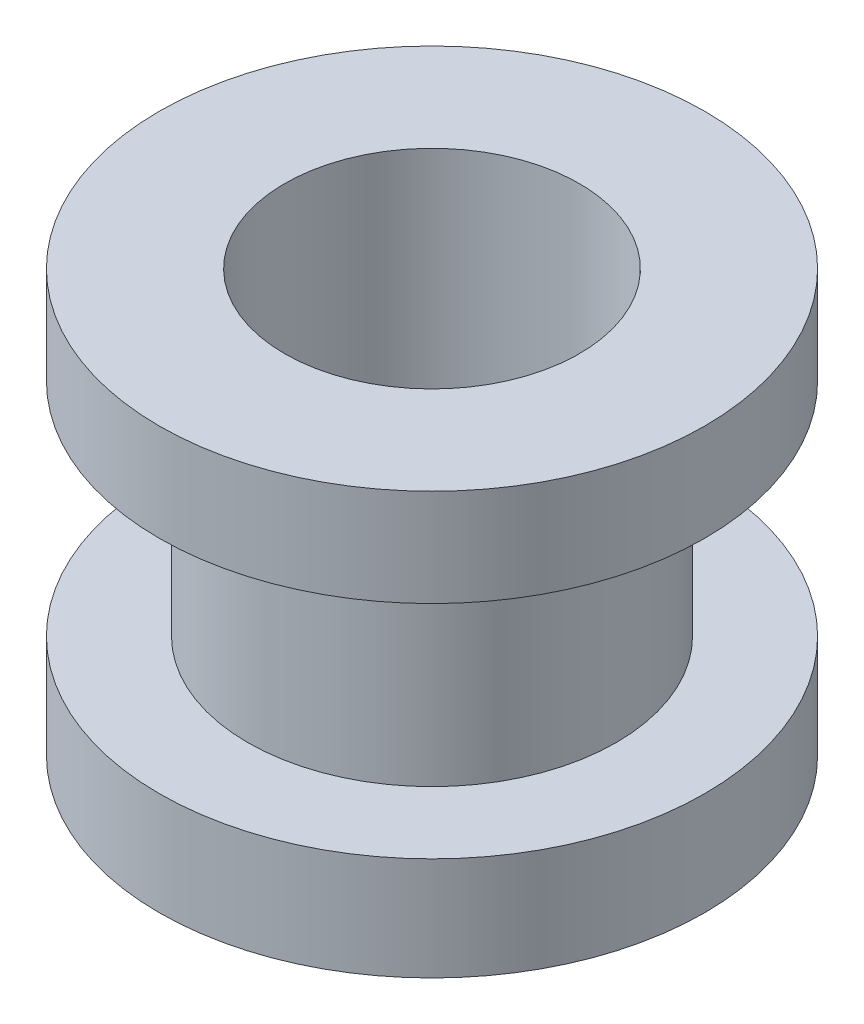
ISO-10303-21;
HEADER;
FILE_DESCRIPTION(('STEP AP214'),'2;1');
FILE_NAME('part.step','',(''),(''),'','','');
FILE_SCHEMA(('AUTOMOTIVE_DESIGN { 1 0 10303 214 1 1 1 1 }'));
ENDSEC;
DATA;
#1=APPLICATION_CONTEXT('core data for automotive mechanical design processes');
#2=APPLICATION_PROTOCOL_DEFINITION('international standard','automotive_design',2000,#1);
#3=PRODUCT_CONTEXT('',#1,'mechanical');
#4=PRODUCT('Part','Part','',(#3));
#5=PRODUCT_RELATED_PRODUCT_CATEGORY('part','',(#4));
#6=PRODUCT_DEFINITION_FORMATION('','',#4);
#7=PRODUCT_DEFINITION_CONTEXT('part definition',#1,'design');
#8=PRODUCT_DEFINITION('design','',#6,#7);
#9=PRODUCT_DEFINITION_SHAPE('','',#8);
#10=(LENGTH_UNIT() NAMED_UNIT(*) SI_UNIT(.MILLI.,.METRE.));
#11=(NAMED_UNIT(*) PLANE_ANGLE_UNIT() SI_UNIT($,.RADIAN.));
#12=(NAMED_UNIT(*) SI_UNIT($,.STERADIAN.) SOLID_ANGLE_UNIT());
#13=UNCERTAINTY_MEASURE_WITH_UNIT(LENGTH_MEASURE(1.E-05),#10,'distance_accuracy_value','');
#14=(GEOMETRIC_REPRESENTATION_CONTEXT(3) GLOBAL_UNCERTAINTY_ASSIGNED_CONTEXT((#13)) GLOBAL_UNIT_ASSIGNED_CONTEXT((#10,
#11,#12)) REPRESENTATION_CONTEXT('',''));
#15=CARTESIAN_POINT('',(0.,0.,0.));
#16=DIRECTION('',(0.,0.,1.));
#17=DIRECTION('',(1.,0.,0.));
#18=AXIS2_PLACEMENT_3D('',#15,#16,#17);
#19=CARTESIAN_POINT('',(0.,1.6764,0.));
#20=DIRECTION('',(0.,-1.,0.));
#21=DIRECTION('',(0.,0.,-1.));
#22=AXIS2_PLACEMENT_3D('',#19,#20,#21);
#23=CYLINDRICAL_SURFACE('',#22,4.699);
#24=CARTESIAN_POINT('',(0.,1.6764,0.));
#25=DIRECTION('',(0.,1.,0.));
#26=DIRECTION('',(0.,0.,1.));
#27=AXIS2_PLACEMENT_3D('',#24,#25,#26);
#28=CIRCLE('',#27,4.699);
#29=CARTESIAN_POINT('',(0.,1.6764,4.699));
#30=VERTEX_POINT('',#29);
#31=EDGE_CURVE('E10',#30,#30,#28,.T.);
#32=ORIENTED_EDGE('',*,*,#31,.F.);
#33=EDGE_LOOP('',(#32));
#34=FACE_BOUND('',#33,.T.);
#35=CARTESIAN_POINT('',(0.,0.,0.));
#36=DIRECTION('',(0.,1.,0.));
#37=DIRECTION('',(0.,0.,1.));
#38=AXIS2_PLACEMENT_3D('',#35,#36,#37);
#39=CIRCLE('',#38,4.699);
#40=CARTESIAN_POINT('',(0.,0.,4.699));
#41=VERTEX_POINT('',#40);
#42=EDGE_CURVE('E35',#41,#41,#39,.T.);
#43=ORIENTED_EDGE('',*,*,#42,.T.);
#44=EDGE_LOOP('',(#43));
#45=FACE_BOUND('',#44,.T.);
#46=ADVANCED_FACE('F29',(#34,#45),#23,.T.);
#47=CARTESIAN_POINT('',(0.,1.6764,0.));
#48=DIRECTION('',(0.,1.,0.));
#49=DIRECTION('',(0.,0.,1.));
#50=AXIS2_PLACEMENT_3D('',#47,#48,#49);
#51=PLANE('',#50);
#52=CARTESIAN_POINT('',(0.,1.6764,0.));
#53=DIRECTION('',(0.,1.,0.));
#54=DIRECTION('',(0.,0.,1.));
#55=AXIS2_PLACEMENT_3D('',#52,#53,#54);
#56=CIRCLE('',#55,2.54);
#57=CARTESIAN_POINT('',(0.,1.6764,2.54));
#58=VERTEX_POINT('',#57);
#59=EDGE_CURVE('E57',#58,#58,#56,.T.);
#60=ORIENTED_EDGE('',*,*,#59,.F.);
#61=EDGE_LOOP('',(#60));
#62=FACE_BOUND('',#61,.T.);
#63=ORIENTED_EDGE('',*,*,#31,.T.);
#64=EDGE_LOOP('',(#63));
#65=FACE_BOUND('',#64,.T.);
#66=ADVANCED_FACE('F63',(#62,#65),#51,.T.);
#67=CARTESIAN_POINT('',(0.,0.,0.));
#68=DIRECTION('',(0.,1.,0.));
#69=DIRECTION('',(0.,0.,1.));
#70=AXIS2_PLACEMENT_3D('',#67,#68,#69);
#71=PLANE('',#70);
#72=CARTESIAN_POINT('',(0.,0.,0.));
#73=DIRECTION('',(0.,1.,0.));
#74=DIRECTION('',(0.,0.,1.));
#75=AXIS2_PLACEMENT_3D('',#72,#73,#74);
#76=CIRCLE('',#75,3.175);
#77=CARTESIAN_POINT('',(0.,0.,3.175));
#78=VERTEX_POINT('',#77);
#79=EDGE_CURVE('E39',#78,#78,#76,.T.);
#80=ORIENTED_EDGE('',*,*,#79,.T.);
#81=EDGE_LOOP('',(#80));
#82=FACE_BOUND('',#81,.T.);
#83=ORIENTED_EDGE('',*,*,#42,.F.);
#84=EDGE_LOOP('',(#83));
#85=FACE_BOUND('',#84,.T.);
#86=ADVANCED_FACE('F65',(#82,#85),#71,.F.);
#87=CARTESIAN_POINT('',(0.,-3.81,0.));
#88=DIRECTION('',(0.,1.,0.));
#89=DIRECTION('',(0.,0.,1.));
#90=AXIS2_PLACEMENT_3D('',#87,#88,#89);
#91=CYLINDRICAL_SURFACE('',#90,3.175);
#92=CARTESIAN_POINT('',(0.,-3.81,0.));
#93=DIRECTION('',(0.,-1.,0.));
#94=DIRECTION('',(0.,0.,-1.));
#95=AXIS2_PLACEMENT_3D('',#92,#93,#94);
#96=CIRCLE('',#95,3.175);
#97=CARTESIAN_POINT('',(0.,-3.81,3.175));
#98=VERTEX_POINT('',#97);
#99=EDGE_CURVE('E43',#98,#98,#96,.F.);
#100=CARTESIAN_POINT('',(0.,-3.81,3.175));
#101=CARTESIAN_POINT('',(0.,-3.7703125,3.175));
#102=CARTESIAN_POINT('',(0.,-3.730625,3.175));
#103=CARTESIAN_POINT('',(0.,-3.65125,3.175));
#104=CARTESIAN_POINT('',(0.,-3.6115625,3.175));
#105=CARTESIAN_POINT('',(0.,-3.5321875,3.175));
#106=CARTESIAN_POINT('',(0.,-3.4925,3.175));
#107=CARTESIAN_POINT('',(0.,-3.413125,3.175));
#108=CARTESIAN_POINT('',(0.,-3.3734375,3.175));
#109=CARTESIAN_POINT('',(0.,-3.2940625,3.175));
#110=CARTESIAN_POINT('',(0.,-3.254375,3.175));
#111=CARTESIAN_POINT('',(0.,-3.175,3.175));
#112=CARTESIAN_POINT('',(0.,-3.1353125,3.175));
#113=CARTESIAN_POINT('',(0.,-3.0559375,3.175));
#114=CARTESIAN_POINT('',(0.,-3.01625,3.175));
#115=CARTESIAN_POINT('',(0.,-2.936875,3.175));
#116=CARTESIAN_POINT('',(0.,-2.8971875,3.175));
#117=CARTESIAN_POINT('',(0.,-2.8178125,3.175));
#118=CARTESIAN_POINT('',(0.,-2.778125,3.175));
#119=CARTESIAN_POINT('',(0.,-2.69875,3.175));
#120=CARTESIAN_POINT('',(0.,-2.6590625,3.175));
#121=CARTESIAN_POINT('',(0.,-2.5796875,3.175));
#122=CARTESIAN_POINT('',(0.,-2.54,3.175));
#123=CARTESIAN_POINT('',(0.,-2.460625,3.175));
#124=CARTESIAN_POINT('',(0.,-2.4209375,3.175));
#125=CARTESIAN_POINT('',(0.,-2.3415625,3.175));
#126=CARTESIAN_POINT('',(0.,-2.301875,3.175));
#127=CARTESIAN_POINT('',(0.,-2.2225,3.175));
#128=CARTESIAN_POINT('',(0.,-2.1828125,3.175));
#129=CARTESIAN_POINT('',(0.,-2.1034375,3.175));
#130=CARTESIAN_POINT('',(0.,-2.06375,3.175));
#131=CARTESIAN_POINT('',(0.,-1.984375,3.175));
#132=CARTESIAN_POINT('',(0.,-1.9446875,3.175));
#133=CARTESIAN_POINT('',(0.,-1.8653125,3.175));
#134=CARTESIAN_POINT('',(0.,-1.825625,3.175));
#135=CARTESIAN_POINT('',(0.,-1.74625,3.175));
#136=CARTESIAN_POINT('',(0.,-1.7065625,3.175));
#137=CARTESIAN_POINT('',(0.,-1.6271875,3.175));
#138=CARTESIAN_POINT('',(0.,-1.5875,3.175));
#139=CARTESIAN_POINT('',(0.,-1.508125,3.175));
#140=CARTESIAN_POINT('',(0.,-1.4684375,3.175));
#141=CARTESIAN_POINT('',(0.,-1.3890625,3.175));
#142=CARTESIAN_POINT('',(0.,-1.349375,3.175));
#143=CARTESIAN_POINT('',(0.,-1.27,3.175));
#144=CARTESIAN_POINT('',(0.,-1.2303125,3.175));
#145=CARTESIAN_POINT('',(0.,-1.1509375,3.175));
#146=CARTESIAN_POINT('',(0.,-1.11125,3.175));
#147=CARTESIAN_POINT('',(0.,-1.031875,3.175));
#148=CARTESIAN_POINT('',(0.,-0.9921875,3.175));
#149=CARTESIAN_POINT('',(0.,-0.9128125,3.175));
#150=CARTESIAN_POINT('',(0.,-0.873125,3.175));
#151=CARTESIAN_POINT('',(0.,-0.79375,3.175));
#152=CARTESIAN_POINT('',(0.,-0.7540625,3.175));
#153=CARTESIAN_POINT('',(0.,-0.6746875,3.175));
#154=CARTESIAN_POINT('',(0.,-0.635,3.175));
#155=CARTESIAN_POINT('',(0.,-0.555625,3.175));
#156=CARTESIAN_POINT('',(0.,-0.5159375,3.175));
#157=CARTESIAN_POINT('',(0.,-0.4365625,3.175));
#158=CARTESIAN_POINT('',(0.,-0.396875,3.175));
#159=CARTESIAN_POINT('',(0.,-0.3175,3.175));
#160=CARTESIAN_POINT('',(0.,-0.2778125,3.175));
#161=CARTESIAN_POINT('',(0.,-0.1984375,3.175));
#162=CARTESIAN_POINT('',(0.,-0.15875,3.175));
#163=CARTESIAN_POINT('',(0.,-0.0793749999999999,3.175));
#164=CARTESIAN_POINT('',(0.,-0.0396874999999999,3.175));
#165=CARTESIAN_POINT('',(0.,0.,3.175));
#166=B_SPLINE_CURVE_WITH_KNOTS('',3,(#100,#101,#102,#103,#104,#105,#106,#107,#108,#109,#110,
#111,#112,#113,#114,#115,#116,#117,#118,#119,#120,#121,#122,#123,#124,#125,#126,#127,#128,#129,
#130,#131,#132,#133,#134,#135,#136,#137,#138,#139,#140,#141,#142,#143,#144,#145,#146,#147,#148,
#149,#150,#151,#152,#153,#154,#155,#156,#157,#158,#159,#160,#161,#162,#163,#164,#165),
.UNSPECIFIED.,.F.,.F.,(4,2,2,2,2,2,2,2,2,2,2,2,2,2,2,2,2,2,2,2,2,2,2,2,2,2,2,2,2,2,2,2,4),(0.,
0.1190625,0.238125,0.3571875,0.47625,0.595312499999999,0.714375,0.833437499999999,
0.952499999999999,1.0715625,1.190625,1.3096875,1.42875,1.5478125,1.666875,1.7859375,1.905,
2.0240625,2.143125,2.2621875,2.38125,2.5003125,2.619375,2.7384375,2.8575,2.9765625,3.095625,
3.2146875,3.33375,3.4528125,3.571875,3.6909375,3.81),.UNSPECIFIED.);
#167=EDGE_CURVE('BSEAM70',#98,#78,#166,.T.);
#168=ORIENTED_EDGE('',*,*,#99,.T.);
#169=ORIENTED_EDGE('',*,*,#79,.F.);
#170=ORIENTED_EDGE('',*,*,#167,.T.);
#171=ORIENTED_EDGE('',*,*,#167,.F.);
#172=EDGE_LOOP('',(#168,#170,#169,#171));
#173=FACE_BOUND('',#172,.T.);
#174=ADVANCED_FACE('F70',(#173),#91,.T.);
#175=CARTESIAN_POINT('',(0.,-5.588,0.));
#176=DIRECTION('',(0.,1.,0.));
#177=DIRECTION('',(0.,0.,1.));
#178=AXIS2_PLACEMENT_3D('',#175,#176,#177);
#179=CYLINDRICAL_SURFACE('',#178,4.699);
#180=CARTESIAN_POINT('',(0.,-5.588,0.));
#181=DIRECTION('',(0.,-1.,0.));
#182=DIRECTION('',(0.,0.,-1.));
#183=AXIS2_PLACEMENT_3D('',#180,#181,#182);
#184=CIRCLE('',#183,4.699);
#185=CARTESIAN_POINT('',(0.,-5.588,-4.699));
#186=VERTEX_POINT('',#185);
#187=EDGE_CURVE('E48',#186,#186,#184,.T.);
#188=ORIENTED_EDGE('',*,*,#187,.F.);
#189=EDGE_LOOP('',(#188));
#190=FACE_BOUND('',#189,.T.);
#191=CARTESIAN_POINT('',(0.,-3.81,0.));
#192=DIRECTION('',(0.,-1.,0.));
#193=DIRECTION('',(0.,0.,-1.));
#194=AXIS2_PLACEMENT_3D('',#191,#192,#193);
#195=CIRCLE('',#194,4.699);
#196=CARTESIAN_POINT('',(0.,-3.81,-4.699));
#197=VERTEX_POINT('',#196);
#198=EDGE_CURVE('E51',#197,#197,#195,.T.);
#199=ORIENTED_EDGE('',*,*,#198,.T.);
#200=EDGE_LOOP('',(#199));
#201=FACE_BOUND('',#200,.T.);
#202=ADVANCED_FACE('F77',(#190,#201),#179,.T.);
#203=CARTESIAN_POINT('',(0.,-5.588,0.));
#204=DIRECTION('',(0.,-1.,0.));
#205=DIRECTION('',(0.,0.,-1.));
#206=AXIS2_PLACEMENT_3D('',#203,#204,#205);
#207=PLANE('',#206);
#208=CARTESIAN_POINT('',(0.,-5.588,0.));
#209=DIRECTION('',(0.,1.,0.));
#210=DIRECTION('',(0.,0.,1.));
#211=AXIS2_PLACEMENT_3D('',#208,#209,#210);
#212=CIRCLE('',#211,2.54);
#213=CARTESIAN_POINT('',(0.,-5.588,2.54));
#214=VERTEX_POINT('',#213);
#215=EDGE_CURVE('E54',#214,#214,#212,.T.);
#216=ORIENTED_EDGE('',*,*,#215,.T.);
#217=EDGE_LOOP('',(#216));
#218=FACE_BOUND('',#217,.T.);
#219=ORIENTED_EDGE('',*,*,#187,.T.);
#220=EDGE_LOOP('',(#219));
#221=FACE_BOUND('',#220,.T.);
#222=ADVANCED_FACE('F81',(#218,#221),#207,.T.);
#223=CARTESIAN_POINT('',(0.,-3.81,0.));
#224=DIRECTION('',(0.,-1.,0.));
#225=DIRECTION('',(0.,0.,-1.));
#226=AXIS2_PLACEMENT_3D('',#223,#224,#225);
#227=PLANE('',#226);
#228=ORIENTED_EDGE('',*,*,#99,.F.);
#229=EDGE_LOOP('',(#228));
#230=FACE_BOUND('',#229,.T.);
#231=ORIENTED_EDGE('',*,*,#198,.F.);
#232=EDGE_LOOP('',(#231));
#233=FACE_BOUND('',#232,.T.);
#234=ADVANCED_FACE('F85',(#230,#233),#227,.F.);
#235=CARTESIAN_POINT('',(0.,-5.588,0.));
#236=DIRECTION('',(0.,1.,0.));
#237=DIRECTION('',(0.,0.,1.));
#238=AXIS2_PLACEMENT_3D('',#235,#236,#237);
#239=CYLINDRICAL_SURFACE('',#238,2.54);
#240=ORIENTED_EDGE('',*,*,#215,.F.);
#241=EDGE_LOOP('',(#240));
#242=FACE_BOUND('',#241,.T.);
#243=ORIENTED_EDGE('',*,*,#59,.T.);
#244=EDGE_LOOP('',(#243));
#245=FACE_BOUND('',#244,.T.);
#246=ADVANCED_FACE('F61',(#242,#245),#239,.F.);
#247=CLOSED_SHELL('',(#46,#66,#86,#174,#202,#222,#234,#246));
#248=MANIFOLD_SOLID_BREP('B2',#247);
#249=ADVANCED_BREP_SHAPE_REPRESENTATION('',(#18,#248),#14);
#250=SHAPE_DEFINITION_REPRESENTATION(#9,#249);
ENDSEC;
END-ISO-10303-21;
